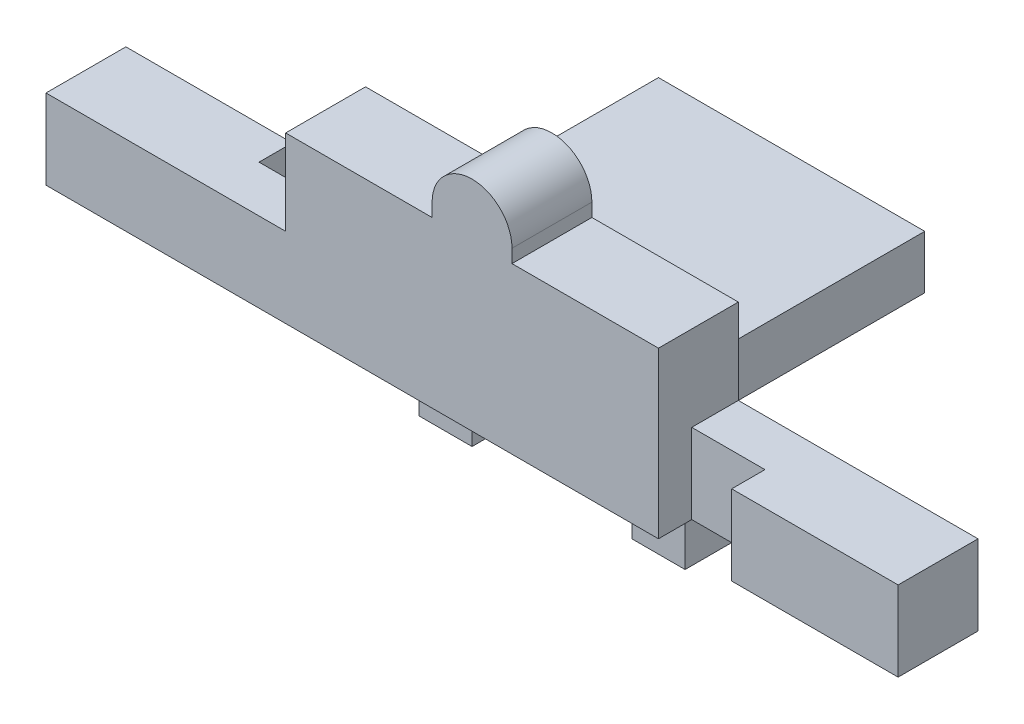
ISO-10303-21;
HEADER;
FILE_DESCRIPTION(('STEP AP214'),'2;1');
FILE_NAME('part.step','',(''),(''),'','','');
FILE_SCHEMA(('AUTOMOTIVE_DESIGN { 1 0 10303 214 1 1 1 1 }'));
ENDSEC;
DATA;
#1=APPLICATION_CONTEXT('core data for automotive mechanical design processes');
#2=APPLICATION_PROTOCOL_DEFINITION('international standard','automotive_design',2000,#1);
#3=PRODUCT_CONTEXT('',#1,'mechanical');
#4=PRODUCT('Part','Part','',(#3));
#5=PRODUCT_RELATED_PRODUCT_CATEGORY('part','',(#4));
#6=PRODUCT_DEFINITION_FORMATION('','',#4);
#7=PRODUCT_DEFINITION_CONTEXT('part definition',#1,'design');
#8=PRODUCT_DEFINITION('design','',#6,#7);
#9=PRODUCT_DEFINITION_SHAPE('','',#8);
#10=(LENGTH_UNIT() NAMED_UNIT(*) SI_UNIT(.MILLI.,.METRE.));
#11=(NAMED_UNIT(*) PLANE_ANGLE_UNIT() SI_UNIT($,.RADIAN.));
#12=(NAMED_UNIT(*) SI_UNIT($,.STERADIAN.) SOLID_ANGLE_UNIT());
#13=UNCERTAINTY_MEASURE_WITH_UNIT(LENGTH_MEASURE(1.E-05),#10,'distance_accuracy_value','');
#14=(GEOMETRIC_REPRESENTATION_CONTEXT(3) GLOBAL_UNCERTAINTY_ASSIGNED_CONTEXT((#13)) GLOBAL_UNIT_ASSIGNED_CONTEXT((#10,
#11,#12)) REPRESENTATION_CONTEXT('',''));
#15=CARTESIAN_POINT('',(0.,0.,0.));
#16=DIRECTION('',(0.,0.,1.));
#17=DIRECTION('',(1.,0.,0.));
#18=AXIS2_PLACEMENT_3D('',#15,#16,#17);
#19=CARTESIAN_POINT('',(0.,0.,3.));
#20=DIRECTION('',(0.,-1.,0.));
#21=DIRECTION('',(1.,0.,0.));
#22=AXIS2_PLACEMENT_3D('',#19,#20,#21);
#23=PLANE('',#22);
#24=DIRECTION('',(0.,0.,-1.));
#25=VECTOR('',#24,1.);
#26=CARTESIAN_POINT('',(-4.,0.,0.));
#27=LINE('',#26,#25);
#28=CARTESIAN_POINT('',(-4.,0.,0.));
#29=VERTEX_POINT('',#28);
#30=CARTESIAN_POINT('',(-4.,0.,-1.75));
#31=VERTEX_POINT('',#30);
#32=EDGE_CURVE('E487',#29,#31,#27,.T.);
#33=ORIENTED_EDGE('',*,*,#32,.F.);
#34=DIRECTION('',(1.,0.,0.));
#35=VECTOR('',#34,1.);
#36=CARTESIAN_POINT('',(-14.,0.,0.));
#37=LINE('',#36,#35);
#38=CARTESIAN_POINT('',(-10.,0.,0.));
#39=VERTEX_POINT('',#38);
#40=EDGE_CURVE('E52',#39,#29,#37,.T.);
#41=ORIENTED_EDGE('',*,*,#40,.F.);
#42=DIRECTION('',(0.,0.,1.));
#43=VECTOR('',#42,1.);
#44=CARTESIAN_POINT('',(-10.,0.,0.));
#45=LINE('',#44,#43);
#46=CARTESIAN_POINT('',(-10.,0.,-1.75442058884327));
#47=VERTEX_POINT('',#46);
#48=EDGE_CURVE('E299',#47,#39,#45,.T.);
#49=ORIENTED_EDGE('',*,*,#48,.F.);
#50=DIRECTION('',(1.,0.,0.));
#51=VECTOR('',#50,1.);
#52=CARTESIAN_POINT('',(-12.,0.,-1.75442058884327));
#53=LINE('',#52,#51);
#54=CARTESIAN_POINT('',(-12.,0.,-1.75442058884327));
#55=VERTEX_POINT('',#54);
#56=EDGE_CURVE('E289',#55,#47,#53,.T.);
#57=ORIENTED_EDGE('',*,*,#56,.F.);
#58=DIRECTION('',(0.,0.,-1.));
#59=VECTOR('',#58,1.);
#60=CARTESIAN_POINT('',(-12.,0.,3.));
#61=LINE('',#60,#59);
#62=CARTESIAN_POINT('',(-12.,0.,-9.));
#63=VERTEX_POINT('',#62);
#64=EDGE_CURVE('E398',#55,#63,#61,.T.);
#65=ORIENTED_EDGE('',*,*,#64,.T.);
#66=DIRECTION('',(1.,0.,0.));
#67=VECTOR('',#66,1.);
#68=CARTESIAN_POINT('',(-12.,0.,-9.));
#69=LINE('',#68,#67);
#70=CARTESIAN_POINT('',(-2.,0.,-9.));
#71=VERTEX_POINT('',#70);
#72=EDGE_CURVE('E410',#63,#71,#69,.T.);
#73=ORIENTED_EDGE('',*,*,#72,.T.);
#74=DIRECTION('',(0.,0.,1.));
#75=VECTOR('',#74,1.);
#76=CARTESIAN_POINT('',(-2.,0.,3.));
#77=LINE('',#76,#75);
#78=CARTESIAN_POINT('',(-2.,0.,-1.75));
#79=VERTEX_POINT('',#78);
#80=EDGE_CURVE('E402',#71,#79,#77,.T.);
#81=ORIENTED_EDGE('',*,*,#80,.T.);
#82=DIRECTION('',(1.,0.,0.));
#83=VECTOR('',#82,1.);
#84=CARTESIAN_POINT('',(-2.,0.,-1.75));
#85=LINE('',#84,#83);
#86=EDGE_CURVE('E60',#31,#79,#85,.T.);
#87=ORIENTED_EDGE('',*,*,#86,.F.);
#88=EDGE_LOOP('',(#33,#41,#49,#57,#65,#73,#81,#87));
#89=FACE_BOUND('',#88,.T.);
#90=ADVANCED_FACE('F35',(#89),#23,.T.);
#91=CARTESIAN_POINT('',(0.,0.,3.));
#92=DIRECTION('',(1.,0.,0.));
#93=DIRECTION('',(0.,1.,0.));
#94=AXIS2_PLACEMENT_3D('',#91,#92,#93);
#95=PLANE('',#94);
#96=DIRECTION('',(0.,-1.,0.));
#97=VECTOR('',#96,1.);
#98=CARTESIAN_POINT('',(0.,0.,3.));
#99=LINE('',#98,#97);
#100=CARTESIAN_POINT('',(0.,5.2,3.));
#101=VERTEX_POINT('',#100);
#102=CARTESIAN_POINT('',(0.,-1.,3.));
#103=VERTEX_POINT('',#102);
#104=EDGE_CURVE('E432',#101,#103,#99,.T.);
#105=ORIENTED_EDGE('',*,*,#104,.T.);
#106=DIRECTION('',(0.,0.,1.));
#107=VECTOR('',#106,1.);
#108=CARTESIAN_POINT('',(0.,-1.,3.));
#109=LINE('',#108,#107);
#110=CARTESIAN_POINT('',(0.,-1.,1.75));
#111=VERTEX_POINT('',#110);
#112=EDGE_CURVE('E262',#111,#103,#109,.T.);
#113=ORIENTED_EDGE('',*,*,#112,.F.);
#114=DIRECTION('',(0.,1.,0.));
#115=VECTOR('',#114,1.);
#116=CARTESIAN_POINT('',(0.,-1.,1.75));
#117=LINE('',#116,#115);
#118=CARTESIAN_POINT('',(0.,2.,1.75));
#119=VERTEX_POINT('',#118);
#120=EDGE_CURVE('E11',#111,#119,#117,.T.);
#121=ORIENTED_EDGE('',*,*,#120,.T.);
#122=DIRECTION('',(0.,0.,1.));
#123=VECTOR('',#122,1.);
#124=CARTESIAN_POINT('',(0.,2.,0.));
#125=LINE('',#124,#123);
#126=CARTESIAN_POINT('',(0.,2.,0.));
#127=VERTEX_POINT('',#126);
#128=EDGE_CURVE('E330',#127,#119,#125,.T.);
#129=ORIENTED_EDGE('',*,*,#128,.F.);
#130=DIRECTION('',(0.,-1.,0.));
#131=VECTOR('',#130,1.);
#132=CARTESIAN_POINT('',(0.,0.,0.));
#133=LINE('',#132,#131);
#134=CARTESIAN_POINT('',(0.,5.2,0.));
#135=VERTEX_POINT('',#134);
#136=EDGE_CURVE('E245',#135,#127,#133,.T.);
#137=ORIENTED_EDGE('',*,*,#136,.F.);
#138=DIRECTION('',(0.,0.,-1.));
#139=VECTOR('',#138,1.);
#140=CARTESIAN_POINT('',(0.,5.2,3.));
#141=LINE('',#140,#139);
#142=EDGE_CURVE('E434',#101,#135,#141,.T.);
#143=ORIENTED_EDGE('',*,*,#142,.F.);
#144=EDGE_LOOP('',(#105,#113,#121,#129,#137,#143));
#145=FACE_BOUND('',#144,.T.);
#146=ADVANCED_FACE('F521',(#145),#95,.T.);
#147=CARTESIAN_POINT('',(-14.,0.,3.));
#148=DIRECTION('',(-1.,0.,0.));
#149=DIRECTION('',(0.,-1.,0.));
#150=AXIS2_PLACEMENT_3D('',#147,#148,#149);
#151=PLANE('',#150);
#152=DIRECTION('',(0.,1.,0.));
#153=VECTOR('',#152,1.);
#154=CARTESIAN_POINT('',(-14.,0.,0.));
#155=LINE('',#154,#153);
#156=CARTESIAN_POINT('',(-14.,-1.,0.));
#157=VERTEX_POINT('',#156);
#158=CARTESIAN_POINT('',(-14.,5.2,0.));
#159=VERTEX_POINT('',#158);
#160=EDGE_CURVE('E234',#157,#159,#155,.T.);
#161=ORIENTED_EDGE('',*,*,#160,.F.);
#162=DIRECTION('',(0.,0.,-1.));
#163=VECTOR('',#162,1.);
#164=CARTESIAN_POINT('',(-14.,-1.,3.));
#165=LINE('',#164,#163);
#166=CARTESIAN_POINT('',(-14.,-1.,1.25));
#167=VERTEX_POINT('',#166);
#168=EDGE_CURVE('E237',#167,#157,#165,.T.);
#169=ORIENTED_EDGE('',*,*,#168,.F.);
#170=DIRECTION('',(0.,1.,0.));
#171=VECTOR('',#170,1.);
#172=CARTESIAN_POINT('',(-14.,-1.,1.25));
#173=LINE('',#172,#171);
#174=CARTESIAN_POINT('',(-14.,2.,1.25));
#175=VERTEX_POINT('',#174);
#176=EDGE_CURVE('E44',#167,#175,#173,.T.);
#177=ORIENTED_EDGE('',*,*,#176,.T.);
#178=DIRECTION('',(0.,0.,-1.));
#179=VECTOR('',#178,1.);
#180=CARTESIAN_POINT('',(-14.,2.,0.));
#181=LINE('',#180,#179);
#182=CARTESIAN_POINT('',(-14.,2.,3.));
#183=VERTEX_POINT('',#182);
#184=EDGE_CURVE('E366',#183,#175,#181,.T.);
#185=ORIENTED_EDGE('',*,*,#184,.F.);
#186=DIRECTION('',(0.,1.,0.));
#187=VECTOR('',#186,1.);
#188=CARTESIAN_POINT('',(-14.,0.,3.));
#189=LINE('',#188,#187);
#190=CARTESIAN_POINT('',(-14.,5.2,3.));
#191=VERTEX_POINT('',#190);
#192=EDGE_CURVE('E430',#183,#191,#189,.T.);
#193=ORIENTED_EDGE('',*,*,#192,.T.);
#194=DIRECTION('',(0.,0.,-1.));
#195=VECTOR('',#194,1.);
#196=CARTESIAN_POINT('',(-14.,5.2,3.));
#197=LINE('',#196,#195);
#198=EDGE_CURVE('E240',#191,#159,#197,.T.);
#199=ORIENTED_EDGE('',*,*,#198,.T.);
#200=EDGE_LOOP('',(#161,#169,#177,#185,#193,#199));
#201=FACE_BOUND('',#200,.T.);
#202=ADVANCED_FACE('F236',(#201),#151,.T.);
#203=CARTESIAN_POINT('',(0.,5.2,3.));
#204=DIRECTION('',(0.,1.,0.));
#205=DIRECTION('',(-1.,0.,0.));
#206=AXIS2_PLACEMENT_3D('',#203,#204,#205);
#207=PLANE('',#206);
#208=DIRECTION('',(1.,0.,0.));
#209=VECTOR('',#208,1.);
#210=CARTESIAN_POINT('',(0.,5.2,0.));
#211=LINE('',#210,#209);
#212=CARTESIAN_POINT('',(-5.5,5.2,0.));
#213=VERTEX_POINT('',#212);
#214=EDGE_CURVE('E416',#213,#135,#211,.T.);
#215=ORIENTED_EDGE('',*,*,#214,.F.);
#216=DIRECTION('',(0.,0.,-1.));
#217=VECTOR('',#216,1.);
#218=CARTESIAN_POINT('',(-5.5,5.2,3.));
#219=LINE('',#218,#217);
#220=CARTESIAN_POINT('',(-5.5,5.2,3.));
#221=VERTEX_POINT('',#220);
#222=EDGE_CURVE('E456',#221,#213,#219,.T.);
#223=ORIENTED_EDGE('',*,*,#222,.F.);
#224=DIRECTION('',(1.,0.,0.));
#225=VECTOR('',#224,1.);
#226=CARTESIAN_POINT('',(0.,5.2,3.));
#227=LINE('',#226,#225);
#228=EDGE_CURVE('E419',#221,#101,#227,.T.);
#229=ORIENTED_EDGE('',*,*,#228,.T.);
#230=ORIENTED_EDGE('',*,*,#142,.T.);
#231=EDGE_LOOP('',(#215,#223,#229,#230));
#232=FACE_BOUND('',#231,.T.);
#233=ADVANCED_FACE('F532',(#232),#207,.T.);
#234=CARTESIAN_POINT('',(-5.5,0.,3.));
#235=DIRECTION('',(1.,0.,0.));
#236=DIRECTION('',(0.,0.,-1.));
#237=AXIS2_PLACEMENT_3D('',#234,#235,#236);
#238=PLANE('',#237);
#239=DIRECTION('',(0.,-1.,0.));
#240=VECTOR('',#239,1.);
#241=CARTESIAN_POINT('',(-5.5,0.,0.));
#242=LINE('',#241,#240);
#243=CARTESIAN_POINT('',(-5.5,5.7,0.));
#244=VERTEX_POINT('',#243);
#245=EDGE_CURVE('E437',#244,#213,#242,.T.);
#246=ORIENTED_EDGE('',*,*,#245,.F.);
#247=DIRECTION('',(0.,0.,-1.));
#248=VECTOR('',#247,1.);
#249=CARTESIAN_POINT('',(-5.5,5.7,3.));
#250=LINE('',#249,#248);
#251=CARTESIAN_POINT('',(-5.5,5.7,3.));
#252=VERTEX_POINT('',#251);
#253=EDGE_CURVE('E454',#252,#244,#250,.T.);
#254=ORIENTED_EDGE('',*,*,#253,.F.);
#255=DIRECTION('',(0.,-1.,0.));
#256=VECTOR('',#255,1.);
#257=CARTESIAN_POINT('',(-5.5,0.,3.));
#258=LINE('',#257,#256);
#259=EDGE_CURVE('E422',#252,#221,#258,.T.);
#260=ORIENTED_EDGE('',*,*,#259,.T.);
#261=ORIENTED_EDGE('',*,*,#222,.T.);
#262=EDGE_LOOP('',(#246,#254,#260,#261));
#263=FACE_BOUND('',#262,.T.);
#264=ADVANCED_FACE('F37',(#263),#238,.T.);
#265=CARTESIAN_POINT('',(-7.,5.7,3.));
#266=DIRECTION('',(0.,0.,-1.));
#267=DIRECTION('',(-1.,0.,0.));
#268=AXIS2_PLACEMENT_3D('',#265,#266,#267);
#269=CYLINDRICAL_SURFACE('',#268,1.5);
#270=CARTESIAN_POINT('',(-7.,5.7,0.));
#271=DIRECTION('',(0.,0.,1.));
#272=DIRECTION('',(1.,0.,0.));
#273=AXIS2_PLACEMENT_3D('',#270,#271,#272);
#274=CIRCLE('',#273,1.5);
#275=CARTESIAN_POINT('',(-8.5,5.7,0.));
#276=VERTEX_POINT('',#275);
#277=EDGE_CURVE('E440',#244,#276,#274,.T.);
#278=ORIENTED_EDGE('',*,*,#277,.T.);
#279=DIRECTION('',(0.,0.,-1.));
#280=VECTOR('',#279,1.);
#281=CARTESIAN_POINT('',(-8.5,5.7,3.));
#282=LINE('',#281,#280);
#283=CARTESIAN_POINT('',(-8.5,5.7,3.));
#284=VERTEX_POINT('',#283);
#285=EDGE_CURVE('E451',#284,#276,#282,.T.);
#286=ORIENTED_EDGE('',*,*,#285,.F.);
#287=CARTESIAN_POINT('',(-7.,5.7,3.));
#288=DIRECTION('',(0.,0.,1.));
#289=DIRECTION('',(1.,0.,0.));
#290=AXIS2_PLACEMENT_3D('',#287,#288,#289);
#291=CIRCLE('',#290,1.5);
#292=EDGE_CURVE('E426',#252,#284,#291,.T.);
#293=ORIENTED_EDGE('',*,*,#292,.F.);
#294=ORIENTED_EDGE('',*,*,#253,.T.);
#295=EDGE_LOOP('',(#278,#286,#293,#294));
#296=FACE_BOUND('',#295,.T.);
#297=ADVANCED_FACE('F540',(#296),#269,.T.);
#298=CARTESIAN_POINT('',(-8.5,0.,3.));
#299=DIRECTION('',(1.,0.,0.));
#300=DIRECTION('',(0.,0.,-1.));
#301=AXIS2_PLACEMENT_3D('',#298,#299,#300);
#302=PLANE('',#301);
#303=DIRECTION('',(0.,-1.,0.));
#304=VECTOR('',#303,1.);
#305=CARTESIAN_POINT('',(-8.5,0.,0.));
#306=LINE('',#305,#304);
#307=CARTESIAN_POINT('',(-8.5,5.2,0.));
#308=VERTEX_POINT('',#307);
#309=EDGE_CURVE('E442',#276,#308,#306,.T.);
#310=ORIENTED_EDGE('',*,*,#309,.T.);
#311=DIRECTION('',(0.,0.,-1.));
#312=VECTOR('',#311,1.);
#313=CARTESIAN_POINT('',(-8.5,5.2,3.));
#314=LINE('',#313,#312);
#315=CARTESIAN_POINT('',(-8.5,5.2,3.));
#316=VERTEX_POINT('',#315);
#317=EDGE_CURVE('E449',#316,#308,#314,.T.);
#318=ORIENTED_EDGE('',*,*,#317,.F.);
#319=DIRECTION('',(0.,-1.,0.));
#320=VECTOR('',#319,1.);
#321=CARTESIAN_POINT('',(-8.5,0.,3.));
#322=LINE('',#321,#320);
#323=EDGE_CURVE('E428',#284,#316,#322,.T.);
#324=ORIENTED_EDGE('',*,*,#323,.F.);
#325=ORIENTED_EDGE('',*,*,#285,.T.);
#326=EDGE_LOOP('',(#310,#318,#324,#325));
#327=FACE_BOUND('',#326,.T.);
#328=ADVANCED_FACE('F537',(#327),#302,.F.);
#329=EDGE_CURVE('E246',#159,#308,#211,.T.);
#330=ORIENTED_EDGE('',*,*,#329,.F.);
#331=ORIENTED_EDGE('',*,*,#198,.F.);
#332=EDGE_CURVE('E423',#191,#316,#227,.T.);
#333=ORIENTED_EDGE('',*,*,#332,.T.);
#334=ORIENTED_EDGE('',*,*,#317,.T.);
#335=EDGE_LOOP('',(#330,#331,#333,#334));
#336=FACE_BOUND('',#335,.T.);
#337=ADVANCED_FACE('F533',(#336),#207,.T.);
#338=CARTESIAN_POINT('',(0.,0.,3.));
#339=DIRECTION('',(0.,0.,1.));
#340=DIRECTION('',(1.,0.,0.));
#341=AXIS2_PLACEMENT_3D('',#338,#339,#340);
#342=PLANE('',#341);
#343=ORIENTED_EDGE('',*,*,#192,.F.);
#344=DIRECTION('',(-1.,0.,0.));
#345=VECTOR('',#344,1.);
#346=CARTESIAN_POINT('',(0.,2.,3.));
#347=LINE('',#346,#345);
#348=CARTESIAN_POINT('',(-23.,2.,3.));
#349=VERTEX_POINT('',#348);
#350=EDGE_CURVE('E369',#183,#349,#347,.T.);
#351=ORIENTED_EDGE('',*,*,#350,.T.);
#352=DIRECTION('',(0.,1.,0.));
#353=VECTOR('',#352,1.);
#354=CARTESIAN_POINT('',(-23.,-1.,3.));
#355=LINE('',#354,#353);
#356=CARTESIAN_POINT('',(-23.,-1.,3.));
#357=VERTEX_POINT('',#356);
#358=EDGE_CURVE('E393',#357,#349,#355,.T.);
#359=ORIENTED_EDGE('',*,*,#358,.F.);
#360=DIRECTION('',(-1.,0.,0.));
#361=VECTOR('',#360,1.);
#362=CARTESIAN_POINT('',(0.,-1.,3.));
#363=LINE('',#362,#361);
#364=EDGE_CURVE('E382',#103,#357,#363,.T.);
#365=ORIENTED_EDGE('',*,*,#364,.F.);
#366=ORIENTED_EDGE('',*,*,#104,.F.);
#367=ORIENTED_EDGE('',*,*,#228,.F.);
#368=ORIENTED_EDGE('',*,*,#259,.F.);
#369=ORIENTED_EDGE('',*,*,#292,.T.);
#370=ORIENTED_EDGE('',*,*,#323,.T.);
#371=ORIENTED_EDGE('',*,*,#332,.F.);
#372=EDGE_LOOP('',(#343,#351,#359,#365,#366,#367,#368,#369,#370,#371));
#373=FACE_BOUND('',#372,.T.);
#374=ADVANCED_FACE('F536',(#373),#342,.T.);
#375=CARTESIAN_POINT('',(0.,0.,0.));
#376=DIRECTION('',(0.,0.,1.));
#377=DIRECTION('',(1.,0.,0.));
#378=AXIS2_PLACEMENT_3D('',#375,#376,#377);
#379=PLANE('',#378);
#380=DIRECTION('',(-1.,0.,0.));
#381=VECTOR('',#380,1.);
#382=CARTESIAN_POINT('',(0.,-1.,0.));
#383=LINE('',#382,#381);
#384=CARTESIAN_POINT('',(9.,-0.999999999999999,0.));
#385=VERTEX_POINT('',#384);
#386=CARTESIAN_POINT('',(-2.,-1.,0.));
#387=VERTEX_POINT('',#386);
#388=EDGE_CURVE('E347',#385,#387,#383,.T.);
#389=ORIENTED_EDGE('',*,*,#388,.T.);
#390=DIRECTION('',(0.,1.,0.));
#391=VECTOR('',#390,1.);
#392=CARTESIAN_POINT('',(-2.,0.,0.));
#393=LINE('',#392,#391);
#394=CARTESIAN_POINT('',(-2.,2.,0.));
#395=VERTEX_POINT('',#394);
#396=EDGE_CURVE('E460',#387,#395,#393,.T.);
#397=ORIENTED_EDGE('',*,*,#396,.T.);
#398=DIRECTION('',(1.,0.,0.));
#399=VECTOR('',#398,1.);
#400=CARTESIAN_POINT('',(0.,2.,0.));
#401=LINE('',#400,#399);
#402=CARTESIAN_POINT('',(-12.,2.,0.));
#403=VERTEX_POINT('',#402);
#404=EDGE_CURVE('E458',#403,#395,#401,.T.);
#405=ORIENTED_EDGE('',*,*,#404,.F.);
#406=DIRECTION('',(0.,-1.,0.));
#407=VECTOR('',#406,1.);
#408=CARTESIAN_POINT('',(-12.,0.,0.));
#409=LINE('',#408,#407);
#410=CARTESIAN_POINT('',(-12.,-1.,0.));
#411=VERTEX_POINT('',#410);
#412=EDGE_CURVE('E39',#403,#411,#409,.T.);
#413=ORIENTED_EDGE('',*,*,#412,.T.);
#414=DIRECTION('',(1.,0.,0.));
#415=VECTOR('',#414,1.);
#416=CARTESIAN_POINT('',(-14.,-1.,0.));
#417=LINE('',#416,#415);
#418=EDGE_CURVE('E253',#157,#411,#417,.T.);
#419=ORIENTED_EDGE('',*,*,#418,.F.);
#420=ORIENTED_EDGE('',*,*,#160,.T.);
#421=ORIENTED_EDGE('',*,*,#329,.T.);
#422=ORIENTED_EDGE('',*,*,#309,.F.);
#423=ORIENTED_EDGE('',*,*,#277,.F.);
#424=ORIENTED_EDGE('',*,*,#245,.T.);
#425=ORIENTED_EDGE('',*,*,#214,.T.);
#426=ORIENTED_EDGE('',*,*,#136,.T.);
#427=DIRECTION('',(-1.,0.,0.));
#428=VECTOR('',#427,1.);
#429=CARTESIAN_POINT('',(0.,2.,0.));
#430=LINE('',#429,#428);
#431=CARTESIAN_POINT('',(9.,2.,0.));
#432=VERTEX_POINT('',#431);
#433=EDGE_CURVE('E333',#432,#127,#430,.T.);
#434=ORIENTED_EDGE('',*,*,#433,.F.);
#435=DIRECTION('',(0.,1.,0.));
#436=VECTOR('',#435,1.);
#437=CARTESIAN_POINT('',(9.,-0.999999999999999,0.));
#438=LINE('',#437,#436);
#439=EDGE_CURVE('E354',#385,#432,#438,.T.);
#440=ORIENTED_EDGE('',*,*,#439,.F.);
#441=EDGE_LOOP('',(#389,#397,#405,#413,#419,#420,#421,#422,#423,#424,#425,#426,#434,#440));
#442=FACE_BOUND('',#441,.T.);
#443=ADVANCED_FACE('F260',(#442),#379,.F.);
#444=CARTESIAN_POINT('',(-12.,2.,3.));
#445=DIRECTION('',(-1.,0.,0.));
#446=DIRECTION('',(0.,-1.,0.));
#447=AXIS2_PLACEMENT_3D('',#444,#445,#446);
#448=PLANE('',#447);
#449=ORIENTED_EDGE('',*,*,#412,.F.);
#450=DIRECTION('',(0.,0.,-1.));
#451=VECTOR('',#450,1.);
#452=CARTESIAN_POINT('',(-12.,2.,3.));
#453=LINE('',#452,#451);
#454=CARTESIAN_POINT('',(-12.,2.,-9.));
#455=VERTEX_POINT('',#454);
#456=EDGE_CURVE('E399',#403,#455,#453,.T.);
#457=ORIENTED_EDGE('',*,*,#456,.T.);
#458=DIRECTION('',(0.,-1.,0.));
#459=VECTOR('',#458,1.);
#460=CARTESIAN_POINT('',(-12.,2.,-9.));
#461=LINE('',#460,#459);
#462=EDGE_CURVE('E408',#455,#63,#461,.T.);
#463=ORIENTED_EDGE('',*,*,#462,.T.);
#464=ORIENTED_EDGE('',*,*,#64,.F.);
#465=DIRECTION('',(0.,1.,0.));
#466=VECTOR('',#465,1.);
#467=CARTESIAN_POINT('',(-12.,-4.5,-1.75442058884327));
#468=LINE('',#467,#466);
#469=CARTESIAN_POINT('',(-12.,-4.5,-1.75442058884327));
#470=VERTEX_POINT('',#469);
#471=EDGE_CURVE('E318',#470,#55,#468,.T.);
#472=ORIENTED_EDGE('',*,*,#471,.F.);
#473=DIRECTION('',(0.,0.,-1.));
#474=VECTOR('',#473,1.);
#475=CARTESIAN_POINT('',(-12.,-4.5,0.));
#476=LINE('',#475,#474);
#477=CARTESIAN_POINT('',(-12.,-4.5,0.));
#478=VERTEX_POINT('',#477);
#479=EDGE_CURVE('E295',#478,#470,#476,.T.);
#480=ORIENTED_EDGE('',*,*,#479,.F.);
#481=DIRECTION('',(0.,1.,0.));
#482=VECTOR('',#481,1.);
#483=CARTESIAN_POINT('',(-12.,-4.5,0.));
#484=LINE('',#483,#482);
#485=EDGE_CURVE('E305',#478,#411,#484,.T.);
#486=ORIENTED_EDGE('',*,*,#485,.T.);
#487=EDGE_LOOP('',(#449,#457,#463,#464,#472,#480,#486));
#488=FACE_BOUND('',#487,.T.);
#489=ADVANCED_FACE('F475',(#488),#448,.T.);
#490=CARTESIAN_POINT('',(-2.,2.,3.));
#491=DIRECTION('',(1.,0.,0.));
#492=DIRECTION('',(0.,1.,0.));
#493=AXIS2_PLACEMENT_3D('',#490,#491,#492);
#494=PLANE('',#493);
#495=ORIENTED_EDGE('',*,*,#396,.F.);
#496=DIRECTION('',(0.,1.,0.));
#497=VECTOR('',#496,1.);
#498=CARTESIAN_POINT('',(-2.,-4.5,0.));
#499=LINE('',#498,#497);
#500=CARTESIAN_POINT('',(-2.,-4.5,0.));
#501=VERTEX_POINT('',#500);
#502=EDGE_CURVE('E282',#501,#387,#499,.T.);
#503=ORIENTED_EDGE('',*,*,#502,.F.);
#504=DIRECTION('',(0.,0.,1.));
#505=VECTOR('',#504,1.);
#506=CARTESIAN_POINT('',(-2.,-4.5,0.));
#507=LINE('',#506,#505);
#508=CARTESIAN_POINT('',(-2.,-4.5,-1.75));
#509=VERTEX_POINT('',#508);
#510=EDGE_CURVE('E492',#509,#501,#507,.T.);
#511=ORIENTED_EDGE('',*,*,#510,.F.);
#512=DIRECTION('',(0.,1.,0.));
#513=VECTOR('',#512,1.);
#514=CARTESIAN_POINT('',(-2.,-4.5,-1.75));
#515=LINE('',#514,#513);
#516=EDGE_CURVE('E499',#509,#79,#515,.T.);
#517=ORIENTED_EDGE('',*,*,#516,.T.);
#518=ORIENTED_EDGE('',*,*,#80,.F.);
#519=DIRECTION('',(0.,-1.,0.));
#520=VECTOR('',#519,1.);
#521=CARTESIAN_POINT('',(-2.,2.,-9.));
#522=LINE('',#521,#520);
#523=CARTESIAN_POINT('',(-2.,2.,-9.));
#524=VERTEX_POINT('',#523);
#525=EDGE_CURVE('E414',#524,#71,#522,.T.);
#526=ORIENTED_EDGE('',*,*,#525,.F.);
#527=DIRECTION('',(0.,0.,1.));
#528=VECTOR('',#527,1.);
#529=CARTESIAN_POINT('',(-2.,2.,3.));
#530=LINE('',#529,#528);
#531=EDGE_CURVE('E405',#524,#395,#530,.T.);
#532=ORIENTED_EDGE('',*,*,#531,.T.);
#533=EDGE_LOOP('',(#495,#503,#511,#517,#518,#526,#532));
#534=FACE_BOUND('',#533,.T.);
#535=ADVANCED_FACE('F467',(#534),#494,.T.);
#536=CARTESIAN_POINT('',(0.,2.,0.));
#537=DIRECTION('',(0.,-1.,0.));
#538=DIRECTION('',(1.,0.,0.));
#539=AXIS2_PLACEMENT_3D('',#536,#537,#538);
#540=PLANE('',#539);
#541=ORIENTED_EDGE('',*,*,#456,.F.);
#542=ORIENTED_EDGE('',*,*,#404,.T.);
#543=ORIENTED_EDGE('',*,*,#531,.F.);
#544=DIRECTION('',(1.,0.,0.));
#545=VECTOR('',#544,1.);
#546=CARTESIAN_POINT('',(-12.,2.,-9.));
#547=LINE('',#546,#545);
#548=EDGE_CURVE('E401',#455,#524,#547,.T.);
#549=ORIENTED_EDGE('',*,*,#548,.F.);
#550=EDGE_LOOP('',(#541,#542,#543,#549));
#551=FACE_BOUND('',#550,.T.);
#552=ADVANCED_FACE('F465',(#551),#540,.F.);
#553=CARTESIAN_POINT('',(-12.,2.,-9.));
#554=DIRECTION('',(0.,0.,-1.));
#555=DIRECTION('',(-1.,0.,0.));
#556=AXIS2_PLACEMENT_3D('',#553,#554,#555);
#557=PLANE('',#556);
#558=ORIENTED_EDGE('',*,*,#72,.F.);
#559=ORIENTED_EDGE('',*,*,#462,.F.);
#560=ORIENTED_EDGE('',*,*,#548,.T.);
#561=ORIENTED_EDGE('',*,*,#525,.T.);
#562=EDGE_LOOP('',(#558,#559,#560,#561));
#563=FACE_BOUND('',#562,.T.);
#564=ADVANCED_FACE('F472',(#563),#557,.T.);
#565=CARTESIAN_POINT('',(-16.75,-1.,0.));
#566=DIRECTION('',(1.,0.,0.));
#567=DIRECTION('',(0.,0.,-1.));
#568=AXIS2_PLACEMENT_3D('',#565,#566,#567);
#569=PLANE('',#568);
#570=DIRECTION('',(0.,1.,0.));
#571=VECTOR('',#570,1.);
#572=CARTESIAN_POINT('',(-16.75,-1.,0.));
#573=LINE('',#572,#571);
#574=CARTESIAN_POINT('',(-16.75,-1.,0.));
#575=VERTEX_POINT('',#574);
#576=CARTESIAN_POINT('',(-16.75,2.,0.));
#577=VERTEX_POINT('',#576);
#578=EDGE_CURVE('E389',#575,#577,#573,.T.);
#579=ORIENTED_EDGE('',*,*,#578,.T.);
#580=DIRECTION('',(0.,0.,-1.));
#581=VECTOR('',#580,1.);
#582=CARTESIAN_POINT('',(-16.75,2.,0.));
#583=LINE('',#582,#581);
#584=CARTESIAN_POINT('',(-16.75,2.,1.25));
#585=VERTEX_POINT('',#584);
#586=EDGE_CURVE('E360',#585,#577,#583,.T.);
#587=ORIENTED_EDGE('',*,*,#586,.F.);
#588=DIRECTION('',(0.,1.,0.));
#589=VECTOR('',#588,1.);
#590=CARTESIAN_POINT('',(-16.75,-1.,1.25));
#591=LINE('',#590,#589);
#592=CARTESIAN_POINT('',(-16.75,-1.,1.25));
#593=VERTEX_POINT('',#592);
#594=EDGE_CURVE('E395',#593,#585,#591,.T.);
#595=ORIENTED_EDGE('',*,*,#594,.F.);
#596=DIRECTION('',(0.,0.,-1.));
#597=VECTOR('',#596,1.);
#598=CARTESIAN_POINT('',(-16.75,-1.,0.));
#599=LINE('',#598,#597);
#600=EDGE_CURVE('E378',#593,#575,#599,.T.);
#601=ORIENTED_EDGE('',*,*,#600,.T.);
#602=EDGE_LOOP('',(#579,#587,#595,#601));
#603=FACE_BOUND('',#602,.T.);
#604=ADVANCED_FACE('F600',(#603),#569,.T.);
#605=CARTESIAN_POINT('',(0.,-1.,1.25));
#606=DIRECTION('',(0.,0.,1.));
#607=DIRECTION('',(1.,0.,0.));
#608=AXIS2_PLACEMENT_3D('',#605,#606,#607);
#609=PLANE('',#608);
#610=ORIENTED_EDGE('',*,*,#594,.T.);
#611=DIRECTION('',(1.,0.,0.));
#612=VECTOR('',#611,1.);
#613=CARTESIAN_POINT('',(0.,2.,1.25));
#614=LINE('',#613,#612);
#615=EDGE_CURVE('E363',#585,#175,#614,.T.);
#616=ORIENTED_EDGE('',*,*,#615,.T.);
#617=ORIENTED_EDGE('',*,*,#176,.F.);
#618=DIRECTION('',(1.,0.,0.));
#619=VECTOR('',#618,1.);
#620=CARTESIAN_POINT('',(0.,-1.,1.25));
#621=LINE('',#620,#619);
#622=EDGE_CURVE('E256',#593,#167,#621,.T.);
#623=ORIENTED_EDGE('',*,*,#622,.F.);
#624=EDGE_LOOP('',(#610,#616,#617,#623));
#625=FACE_BOUND('',#624,.T.);
#626=ADVANCED_FACE('F603',(#625),#609,.F.);
#627=CARTESIAN_POINT('',(-23.,-1.,0.));
#628=DIRECTION('',(1.,0.,0.));
#629=DIRECTION('',(0.,1.,0.));
#630=AXIS2_PLACEMENT_3D('',#627,#628,#629);
#631=PLANE('',#630);
#632=ORIENTED_EDGE('',*,*,#358,.T.);
#633=DIRECTION('',(0.,0.,-1.));
#634=VECTOR('',#633,1.);
#635=CARTESIAN_POINT('',(-23.,2.,0.));
#636=LINE('',#635,#634);
#637=CARTESIAN_POINT('',(-23.,2.,0.));
#638=VERTEX_POINT('',#637);
#639=EDGE_CURVE('E372',#349,#638,#636,.T.);
#640=ORIENTED_EDGE('',*,*,#639,.T.);
#641=DIRECTION('',(0.,1.,0.));
#642=VECTOR('',#641,1.);
#643=CARTESIAN_POINT('',(-23.,-1.,0.));
#644=LINE('',#643,#642);
#645=CARTESIAN_POINT('',(-23.,-1.,0.));
#646=VERTEX_POINT('',#645);
#647=EDGE_CURVE('E391',#646,#638,#644,.T.);
#648=ORIENTED_EDGE('',*,*,#647,.F.);
#649=DIRECTION('',(0.,0.,-1.));
#650=VECTOR('',#649,1.);
#651=CARTESIAN_POINT('',(-23.,-1.,0.));
#652=LINE('',#651,#650);
#653=EDGE_CURVE('E384',#357,#646,#652,.T.);
#654=ORIENTED_EDGE('',*,*,#653,.F.);
#655=EDGE_LOOP('',(#632,#640,#648,#654));
#656=FACE_BOUND('',#655,.T.);
#657=ADVANCED_FACE('F593',(#656),#631,.F.);
#658=CARTESIAN_POINT('',(0.,-1.,0.));
#659=DIRECTION('',(0.,0.,-1.));
#660=DIRECTION('',(-1.,0.,0.));
#661=AXIS2_PLACEMENT_3D('',#658,#659,#660);
#662=PLANE('',#661);
#663=ORIENTED_EDGE('',*,*,#647,.T.);
#664=DIRECTION('',(-1.,0.,0.));
#665=VECTOR('',#664,1.);
#666=CARTESIAN_POINT('',(0.,2.,0.));
#667=LINE('',#666,#665);
#668=EDGE_CURVE('E375',#577,#638,#667,.T.);
#669=ORIENTED_EDGE('',*,*,#668,.F.);
#670=ORIENTED_EDGE('',*,*,#578,.F.);
#671=DIRECTION('',(-1.,0.,0.));
#672=VECTOR('',#671,1.);
#673=CARTESIAN_POINT('',(0.,-1.,0.));
#674=LINE('',#673,#672);
#675=EDGE_CURVE('E386',#575,#646,#674,.T.);
#676=ORIENTED_EDGE('',*,*,#675,.T.);
#677=EDGE_LOOP('',(#663,#669,#670,#676));
#678=FACE_BOUND('',#677,.T.);
#679=ADVANCED_FACE('F596',(#678),#662,.T.);
#680=CARTESIAN_POINT('',(0.,-1.,0.));
#681=DIRECTION('',(0.,-1.,0.));
#682=DIRECTION('',(1.,0.,0.));
#683=AXIS2_PLACEMENT_3D('',#680,#681,#682);
#684=PLANE('',#683);
#685=ORIENTED_EDGE('',*,*,#600,.F.);
#686=ORIENTED_EDGE('',*,*,#622,.T.);
#687=ORIENTED_EDGE('',*,*,#168,.T.);
#688=ORIENTED_EDGE('',*,*,#418,.T.);
#689=CARTESIAN_POINT('',(-10.,-1.,0.));
#690=VERTEX_POINT('',#689);
#691=EDGE_CURVE('E263',#411,#690,#417,.T.);
#692=ORIENTED_EDGE('',*,*,#691,.T.);
#693=CARTESIAN_POINT('',(-4.,-1.,0.));
#694=VERTEX_POINT('',#693);
#695=EDGE_CURVE('E268',#690,#694,#417,.T.);
#696=ORIENTED_EDGE('',*,*,#695,.T.);
#697=EDGE_CURVE('E257',#694,#387,#417,.T.);
#698=ORIENTED_EDGE('',*,*,#697,.T.);
#699=ORIENTED_EDGE('',*,*,#388,.F.);
#700=DIRECTION('',(0.,0.,-1.));
#701=VECTOR('',#700,1.);
#702=CARTESIAN_POINT('',(9.,-0.999999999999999,0.));
#703=LINE('',#702,#701);
#704=CARTESIAN_POINT('',(9.,-0.999999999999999,3.));
#705=VERTEX_POINT('',#704);
#706=EDGE_CURVE('E349',#705,#385,#703,.T.);
#707=ORIENTED_EDGE('',*,*,#706,.F.);
#708=DIRECTION('',(1.,0.,0.));
#709=VECTOR('',#708,1.);
#710=CARTESIAN_POINT('',(0.,-1.,3.));
#711=LINE('',#710,#709);
#712=CARTESIAN_POINT('',(2.75,-1.,3.));
#713=VERTEX_POINT('',#712);
#714=EDGE_CURVE('E339',#713,#705,#711,.T.);
#715=ORIENTED_EDGE('',*,*,#714,.F.);
#716=DIRECTION('',(0.,0.,-1.));
#717=VECTOR('',#716,1.);
#718=CARTESIAN_POINT('',(2.75,-1.,0.));
#719=LINE('',#718,#717);
#720=CARTESIAN_POINT('',(2.75,-1.,1.75));
#721=VERTEX_POINT('',#720);
#722=EDGE_CURVE('E342',#713,#721,#719,.T.);
#723=ORIENTED_EDGE('',*,*,#722,.T.);
#724=DIRECTION('',(1.,0.,0.));
#725=VECTOR('',#724,1.);
#726=CARTESIAN_POINT('',(0.,-1.,1.75));
#727=LINE('',#726,#725);
#728=EDGE_CURVE('E344',#111,#721,#727,.T.);
#729=ORIENTED_EDGE('',*,*,#728,.F.);
#730=ORIENTED_EDGE('',*,*,#112,.T.);
#731=ORIENTED_EDGE('',*,*,#364,.T.);
#732=ORIENTED_EDGE('',*,*,#653,.T.);
#733=ORIENTED_EDGE('',*,*,#675,.F.);
#734=EDGE_LOOP('',(#685,#686,#687,#688,#692,#696,#698,#699,#707,#715,#723,#729,#730,#731,#732,#733));
#735=FACE_BOUND('',#734,.T.);
#736=ADVANCED_FACE('F251',(#735),#684,.T.);
#737=CARTESIAN_POINT('',(0.,2.,0.));
#738=DIRECTION('',(0.,-1.,0.));
#739=DIRECTION('',(1.,0.,0.));
#740=AXIS2_PLACEMENT_3D('',#737,#738,#739);
#741=PLANE('',#740);
#742=ORIENTED_EDGE('',*,*,#586,.T.);
#743=ORIENTED_EDGE('',*,*,#668,.T.);
#744=ORIENTED_EDGE('',*,*,#639,.F.);
#745=ORIENTED_EDGE('',*,*,#350,.F.);
#746=ORIENTED_EDGE('',*,*,#184,.T.);
#747=ORIENTED_EDGE('',*,*,#615,.F.);
#748=EDGE_LOOP('',(#742,#743,#744,#745,#746,#747));
#749=FACE_BOUND('',#748,.T.);
#750=ADVANCED_FACE('F605',(#749),#741,.F.);
#751=CARTESIAN_POINT('',(0.,-1.,3.));
#752=DIRECTION('',(0.,0.,1.));
#753=DIRECTION('',(1.,0.,0.));
#754=AXIS2_PLACEMENT_3D('',#751,#752,#753);
#755=PLANE('',#754);
#756=DIRECTION('',(0.,1.,0.));
#757=VECTOR('',#756,1.);
#758=CARTESIAN_POINT('',(9.,-0.999999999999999,3.));
#759=LINE('',#758,#757);
#760=CARTESIAN_POINT('',(9.,2.,3.));
#761=VERTEX_POINT('',#760);
#762=EDGE_CURVE('E352',#705,#761,#759,.T.);
#763=ORIENTED_EDGE('',*,*,#762,.T.);
#764=DIRECTION('',(1.,0.,0.));
#765=VECTOR('',#764,1.);
#766=CARTESIAN_POINT('',(0.,2.,3.));
#767=LINE('',#766,#765);
#768=CARTESIAN_POINT('',(2.75,2.,3.));
#769=VERTEX_POINT('',#768);
#770=EDGE_CURVE('E321',#769,#761,#767,.T.);
#771=ORIENTED_EDGE('',*,*,#770,.F.);
#772=DIRECTION('',(0.,1.,0.));
#773=VECTOR('',#772,1.);
#774=CARTESIAN_POINT('',(2.75,-1.,3.));
#775=LINE('',#774,#773);
#776=EDGE_CURVE('E358',#713,#769,#775,.T.);
#777=ORIENTED_EDGE('',*,*,#776,.F.);
#778=ORIENTED_EDGE('',*,*,#714,.T.);
#779=EDGE_LOOP('',(#763,#771,#777,#778));
#780=FACE_BOUND('',#779,.T.);
#781=ADVANCED_FACE('F583',(#780),#755,.T.);
#782=CARTESIAN_POINT('',(2.75,-1.,0.));
#783=DIRECTION('',(1.,0.,0.));
#784=DIRECTION('',(0.,1.,0.));
#785=AXIS2_PLACEMENT_3D('',#782,#783,#784);
#786=PLANE('',#785);
#787=ORIENTED_EDGE('',*,*,#776,.T.);
#788=DIRECTION('',(0.,0.,-1.));
#789=VECTOR('',#788,1.);
#790=CARTESIAN_POINT('',(2.75,2.,0.));
#791=LINE('',#790,#789);
#792=CARTESIAN_POINT('',(2.75,2.,1.75));
#793=VERTEX_POINT('',#792);
#794=EDGE_CURVE('E324',#769,#793,#791,.T.);
#795=ORIENTED_EDGE('',*,*,#794,.T.);
#796=DIRECTION('',(0.,1.,0.));
#797=VECTOR('',#796,1.);
#798=CARTESIAN_POINT('',(2.75,-1.,1.75));
#799=LINE('',#798,#797);
#800=EDGE_CURVE('E355',#721,#793,#799,.T.);
#801=ORIENTED_EDGE('',*,*,#800,.F.);
#802=ORIENTED_EDGE('',*,*,#722,.F.);
#803=EDGE_LOOP('',(#787,#795,#801,#802));
#804=FACE_BOUND('',#803,.T.);
#805=ADVANCED_FACE('F578',(#804),#786,.F.);
#806=CARTESIAN_POINT('',(0.,-1.,1.75));
#807=DIRECTION('',(0.,0.,1.));
#808=DIRECTION('',(1.,0.,0.));
#809=AXIS2_PLACEMENT_3D('',#806,#807,#808);
#810=PLANE('',#809);
#811=ORIENTED_EDGE('',*,*,#800,.T.);
#812=DIRECTION('',(1.,0.,0.));
#813=VECTOR('',#812,1.);
#814=CARTESIAN_POINT('',(0.,2.,1.75));
#815=LINE('',#814,#813);
#816=EDGE_CURVE('E327',#119,#793,#815,.T.);
#817=ORIENTED_EDGE('',*,*,#816,.F.);
#818=ORIENTED_EDGE('',*,*,#120,.F.);
#819=ORIENTED_EDGE('',*,*,#728,.T.);
#820=EDGE_LOOP('',(#811,#817,#818,#819));
#821=FACE_BOUND('',#820,.T.);
#822=ADVANCED_FACE('F573',(#821),#810,.T.);
#823=CARTESIAN_POINT('',(9.,-0.999999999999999,0.));
#824=DIRECTION('',(1.,0.,0.));
#825=DIRECTION('',(0.,1.,0.));
#826=AXIS2_PLACEMENT_3D('',#823,#824,#825);
#827=PLANE('',#826);
#828=ORIENTED_EDGE('',*,*,#439,.T.);
#829=DIRECTION('',(0.,0.,-1.));
#830=VECTOR('',#829,1.);
#831=CARTESIAN_POINT('',(9.,2.,0.));
#832=LINE('',#831,#830);
#833=EDGE_CURVE('E336',#761,#432,#832,.T.);
#834=ORIENTED_EDGE('',*,*,#833,.F.);
#835=ORIENTED_EDGE('',*,*,#762,.F.);
#836=ORIENTED_EDGE('',*,*,#706,.T.);
#837=EDGE_LOOP('',(#828,#834,#835,#836));
#838=FACE_BOUND('',#837,.T.);
#839=ADVANCED_FACE('F586',(#838),#827,.T.);
#840=CARTESIAN_POINT('',(0.,2.,0.));
#841=DIRECTION('',(0.,-1.,0.));
#842=DIRECTION('',(1.,0.,0.));
#843=AXIS2_PLACEMENT_3D('',#840,#841,#842);
#844=PLANE('',#843);
#845=ORIENTED_EDGE('',*,*,#770,.T.);
#846=ORIENTED_EDGE('',*,*,#833,.T.);
#847=ORIENTED_EDGE('',*,*,#433,.T.);
#848=ORIENTED_EDGE('',*,*,#128,.T.);
#849=ORIENTED_EDGE('',*,*,#816,.T.);
#850=ORIENTED_EDGE('',*,*,#794,.F.);
#851=EDGE_LOOP('',(#845,#846,#847,#848,#849,#850));
#852=FACE_BOUND('',#851,.T.);
#853=ADVANCED_FACE('F570',(#852),#844,.F.);
#854=CARTESIAN_POINT('',(-12.,-4.5,-1.75442058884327));
#855=DIRECTION('',(0.,0.,1.));
#856=DIRECTION('',(1.,0.,0.));
#857=AXIS2_PLACEMENT_3D('',#854,#855,#856);
#858=PLANE('',#857);
#859=ORIENTED_EDGE('',*,*,#56,.T.);
#860=DIRECTION('',(0.,1.,0.));
#861=VECTOR('',#860,1.);
#862=CARTESIAN_POINT('',(-10.,-4.5,-1.75442058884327));
#863=LINE('',#862,#861);
#864=CARTESIAN_POINT('',(-10.,-4.5,-1.75442058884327));
#865=VERTEX_POINT('',#864);
#866=EDGE_CURVE('E315',#865,#47,#863,.T.);
#867=ORIENTED_EDGE('',*,*,#866,.F.);
#868=DIRECTION('',(1.,0.,0.));
#869=VECTOR('',#868,1.);
#870=CARTESIAN_POINT('',(-12.,-4.5,-1.75442058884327));
#871=LINE('',#870,#869);
#872=EDGE_CURVE('E298',#470,#865,#871,.T.);
#873=ORIENTED_EDGE('',*,*,#872,.F.);
#874=ORIENTED_EDGE('',*,*,#471,.T.);
#875=EDGE_LOOP('',(#859,#867,#873,#874));
#876=FACE_BOUND('',#875,.T.);
#877=ADVANCED_FACE('F509',(#876),#858,.F.);
#878=CARTESIAN_POINT('',(-10.,-4.5,0.));
#879=DIRECTION('',(-1.,0.,0.));
#880=DIRECTION('',(0.,-1.,0.));
#881=AXIS2_PLACEMENT_3D('',#878,#879,#880);
#882=PLANE('',#881);
#883=ORIENTED_EDGE('',*,*,#48,.T.);
#884=DIRECTION('',(0.,1.,0.));
#885=VECTOR('',#884,1.);
#886=CARTESIAN_POINT('',(-10.,-4.5,0.));
#887=LINE('',#886,#885);
#888=EDGE_CURVE('E266',#690,#39,#887,.T.);
#889=ORIENTED_EDGE('',*,*,#888,.F.);
#890=DIRECTION('',(0.,1.,0.));
#891=VECTOR('',#890,1.);
#892=CARTESIAN_POINT('',(-10.,-4.5,0.));
#893=LINE('',#892,#891);
#894=CARTESIAN_POINT('',(-10.,-4.5,0.));
#895=VERTEX_POINT('',#894);
#896=EDGE_CURVE('E312',#895,#690,#893,.T.);
#897=ORIENTED_EDGE('',*,*,#896,.F.);
#898=DIRECTION('',(0.,0.,1.));
#899=VECTOR('',#898,1.);
#900=CARTESIAN_POINT('',(-10.,-4.5,0.));
#901=LINE('',#900,#899);
#902=EDGE_CURVE('E301',#865,#895,#901,.T.);
#903=ORIENTED_EDGE('',*,*,#902,.F.);
#904=ORIENTED_EDGE('',*,*,#866,.T.);
#905=EDGE_LOOP('',(#883,#889,#897,#903,#904));
#906=FACE_BOUND('',#905,.T.);
#907=ADVANCED_FACE('F486',(#906),#882,.F.);
#908=CARTESIAN_POINT('',(-12.,-4.5,0.));
#909=DIRECTION('',(0.,0.,-1.));
#910=DIRECTION('',(-1.,0.,0.));
#911=AXIS2_PLACEMENT_3D('',#908,#909,#910);
#912=PLANE('',#911);
#913=ORIENTED_EDGE('',*,*,#896,.T.);
#914=ORIENTED_EDGE('',*,*,#691,.F.);
#915=ORIENTED_EDGE('',*,*,#485,.F.);
#916=DIRECTION('',(-1.,0.,0.));
#917=VECTOR('',#916,1.);
#918=CARTESIAN_POINT('',(-12.,-4.5,0.));
#919=LINE('',#918,#917);
#920=EDGE_CURVE('E303',#895,#478,#919,.T.);
#921=ORIENTED_EDGE('',*,*,#920,.F.);
#922=EDGE_LOOP('',(#913,#914,#915,#921));
#923=FACE_BOUND('',#922,.T.);
#924=ADVANCED_FACE('F482',(#923),#912,.F.);
#925=CARTESIAN_POINT('',(0.,-4.5,0.));
#926=DIRECTION('',(0.,-1.,0.));
#927=DIRECTION('',(1.,0.,0.));
#928=AXIS2_PLACEMENT_3D('',#925,#926,#927);
#929=PLANE('',#928);
#930=ORIENTED_EDGE('',*,*,#479,.T.);
#931=ORIENTED_EDGE('',*,*,#872,.T.);
#932=ORIENTED_EDGE('',*,*,#902,.T.);
#933=ORIENTED_EDGE('',*,*,#920,.T.);
#934=EDGE_LOOP('',(#930,#931,#932,#933));
#935=FACE_BOUND('',#934,.T.);
#936=ADVANCED_FACE('F511',(#935),#929,.T.);
#937=CARTESIAN_POINT('',(-2.,-4.5,0.));
#938=DIRECTION('',(0.,0.,-1.));
#939=DIRECTION('',(-1.,0.,0.));
#940=AXIS2_PLACEMENT_3D('',#937,#938,#939);
#941=PLANE('',#940);
#942=ORIENTED_EDGE('',*,*,#502,.T.);
#943=ORIENTED_EDGE('',*,*,#697,.F.);
#944=DIRECTION('',(0.,1.,0.));
#945=VECTOR('',#944,1.);
#946=CARTESIAN_POINT('',(-4.,-4.5,0.));
#947=LINE('',#946,#945);
#948=CARTESIAN_POINT('',(-4.,-4.5,0.));
#949=VERTEX_POINT('',#948);
#950=EDGE_CURVE('E279',#949,#694,#947,.T.);
#951=ORIENTED_EDGE('',*,*,#950,.F.);
#952=DIRECTION('',(-1.,0.,0.));
#953=VECTOR('',#952,1.);
#954=CARTESIAN_POINT('',(-2.,-4.5,0.));
#955=LINE('',#954,#953);
#956=EDGE_CURVE('E495',#501,#949,#955,.T.);
#957=ORIENTED_EDGE('',*,*,#956,.F.);
#958=EDGE_LOOP('',(#942,#943,#951,#957));
#959=FACE_BOUND('',#958,.T.);
#960=ADVANCED_FACE('F278',(#959),#941,.F.);
#961=CARTESIAN_POINT('',(-4.,-4.5,0.));
#962=DIRECTION('',(1.,0.,0.));
#963=DIRECTION('',(0.,1.,0.));
#964=AXIS2_PLACEMENT_3D('',#961,#962,#963);
#965=PLANE('',#964);
#966=ORIENTED_EDGE('',*,*,#32,.T.);
#967=DIRECTION('',(0.,1.,0.));
#968=VECTOR('',#967,1.);
#969=CARTESIAN_POINT('',(-4.,-4.5,-1.75));
#970=LINE('',#969,#968);
#971=CARTESIAN_POINT('',(-4.,-4.5,-1.75));
#972=VERTEX_POINT('',#971);
#973=EDGE_CURVE('E291',#972,#31,#970,.T.);
#974=ORIENTED_EDGE('',*,*,#973,.F.);
#975=DIRECTION('',(0.,0.,-1.));
#976=VECTOR('',#975,1.);
#977=CARTESIAN_POINT('',(-4.,-4.5,0.));
#978=LINE('',#977,#976);
#979=EDGE_CURVE('E287',#949,#972,#978,.T.);
#980=ORIENTED_EDGE('',*,*,#979,.F.);
#981=ORIENTED_EDGE('',*,*,#950,.T.);
#982=EDGE_CURVE('E285',#694,#29,#947,.T.);
#983=ORIENTED_EDGE('',*,*,#982,.T.);
#984=EDGE_LOOP('',(#966,#974,#980,#981,#983));
#985=FACE_BOUND('',#984,.T.);
#986=ADVANCED_FACE('F284',(#985),#965,.F.);
#987=CARTESIAN_POINT('',(-2.,-4.5,-1.75));
#988=DIRECTION('',(0.,0.,1.));
#989=DIRECTION('',(1.,0.,0.));
#990=AXIS2_PLACEMENT_3D('',#987,#988,#989);
#991=PLANE('',#990);
#992=ORIENTED_EDGE('',*,*,#86,.T.);
#993=ORIENTED_EDGE('',*,*,#516,.F.);
#994=DIRECTION('',(1.,0.,0.));
#995=VECTOR('',#994,1.);
#996=CARTESIAN_POINT('',(-2.,-4.5,-1.75));
#997=LINE('',#996,#995);
#998=EDGE_CURVE('E498',#972,#509,#997,.T.);
#999=ORIENTED_EDGE('',*,*,#998,.F.);
#1000=ORIENTED_EDGE('',*,*,#973,.T.);
#1001=EDGE_LOOP('',(#992,#993,#999,#1000));
#1002=FACE_BOUND('',#1001,.T.);
#1003=ADVANCED_FACE('F506',(#1002),#991,.F.);
#1004=CARTESIAN_POINT('',(0.,-4.5,0.));
#1005=DIRECTION('',(0.,1.,0.));
#1006=DIRECTION('',(-1.,0.,0.));
#1007=AXIS2_PLACEMENT_3D('',#1004,#1005,#1006);
#1008=PLANE('',#1007);
#1009=ORIENTED_EDGE('',*,*,#510,.T.);
#1010=ORIENTED_EDGE('',*,*,#956,.T.);
#1011=ORIENTED_EDGE('',*,*,#979,.T.);
#1012=ORIENTED_EDGE('',*,*,#998,.T.);
#1013=EDGE_LOOP('',(#1009,#1010,#1011,#1012));
#1014=FACE_BOUND('',#1013,.T.);
#1015=ADVANCED_FACE('F730',(#1014),#1008,.F.);
#1016=CARTESIAN_POINT('',(-14.,-1.,0.));
#1017=DIRECTION('',(0.,0.,1.));
#1018=DIRECTION('',(1.,0.,0.));
#1019=AXIS2_PLACEMENT_3D('',#1016,#1017,#1018);
#1020=PLANE('',#1019);
#1021=ORIENTED_EDGE('',*,*,#695,.F.);
#1022=ORIENTED_EDGE('',*,*,#888,.T.);
#1023=ORIENTED_EDGE('',*,*,#40,.T.);
#1024=ORIENTED_EDGE('',*,*,#982,.F.);
#1025=EDGE_LOOP('',(#1021,#1022,#1023,#1024));
#1026=FACE_BOUND('',#1025,.T.);
#1027=ADVANCED_FACE('F727',(#1026),#1020,.F.);
#1028=CLOSED_SHELL('',(#90,#146,#202,#233,#264,#297,#328,#337,#374,#443,#489,#535,#552,#564,
#604,#626,#657,#679,#736,#750,#781,#805,#822,#839,#853,#877,#907,#924,#936,#960,#986,#1003,
#1015,#1027));
#1029=MANIFOLD_SOLID_BREP('B2',#1028);
#1030=ADVANCED_BREP_SHAPE_REPRESENTATION('',(#18,#1029),#14);
#1031=SHAPE_DEFINITION_REPRESENTATION(#9,#1030);
ENDSEC;
END-ISO-10303-21;
